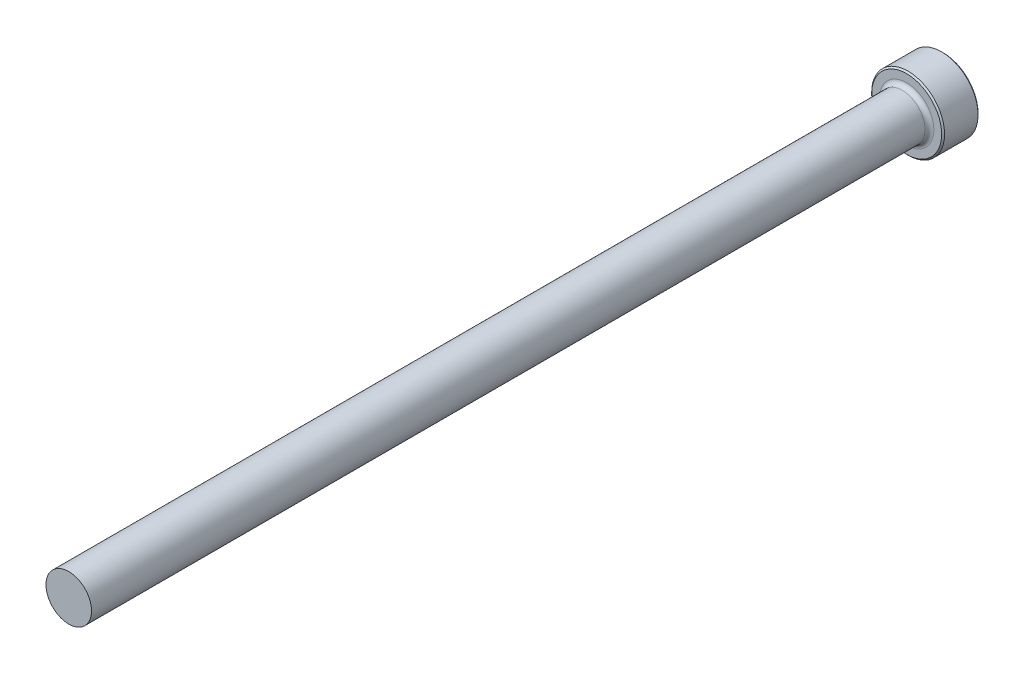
from build123d import *

# Parameters (mm, degrees)
CHAMFER1_SIZE = 0.254


with BuildPart() as part:
    # Sketch1 → Revolve1 (revolve)
    with BuildSketch(Plane(origin=(0, 0, 0), x_dir=(0, 0, -1), z_dir=(1, 0, 0)), mode=Mode.PRIVATE) as revolve1_sk:
        with BuildLine():
            Line((0, 0), (0, 6.35))
            Line((0, 6.35), (-6.35, 6.35))
            Line((-6.35, 6.35), (-6.35, 4.73075))
            ThreePointArc((-6.35, 4.73075), (-6.573184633, 4.191934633), (-7.112, 3.96875))
            Line((-7.112, 3.96875), (-152.4, 3.96875))
            Line((-152.4, 3.96875), (-152.4, 0))
            Line((-152.4, 0), (0, 0))
        make_face()
    revolve(revolve1_sk.sketch.rotate(Axis((0, 0, -25.434744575), (0, 0, 1)), 90), axis=Axis((0, 0, -25.434744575), (0, 0, 1)))

    # Chamfer1
    chamfer1_edges = [part.edges().sort_by_distance(p)[0] for p in [
        (6.35, 0, 0),
        (6.35, 0, 6.35),
    ]]
    chamfer(chamfer1_edges, length=CHAMFER1_SIZE)


solid = part.part
